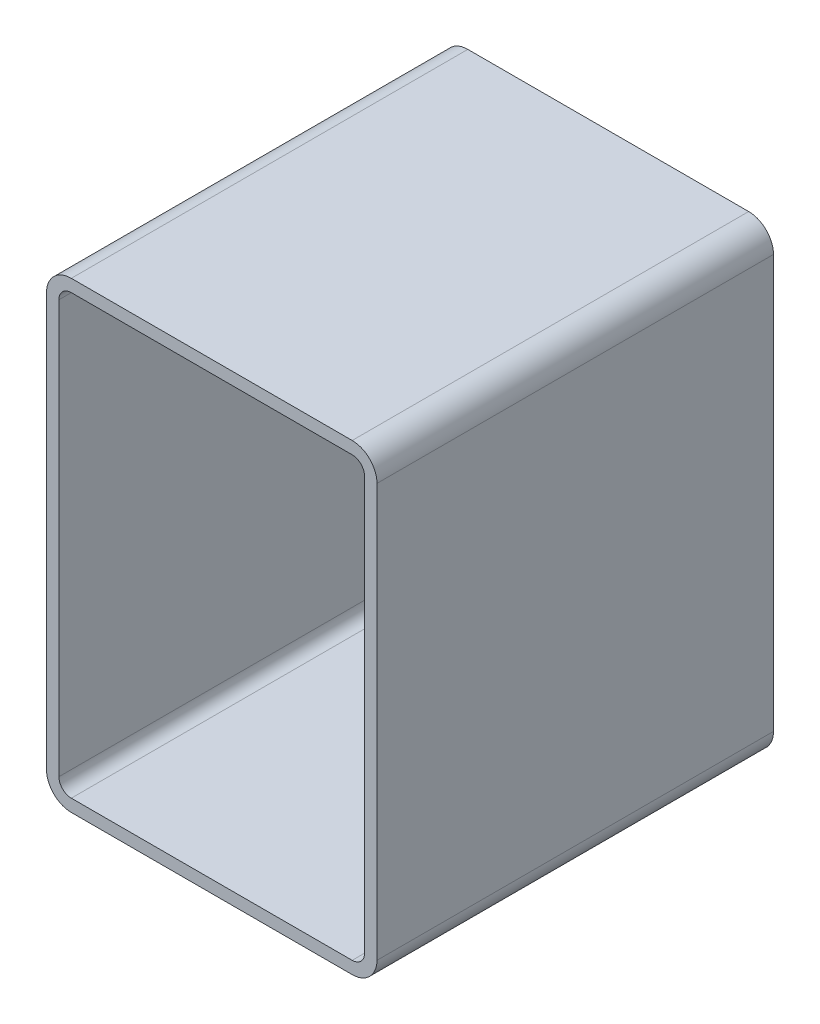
ISO-10303-21;
HEADER;
FILE_DESCRIPTION(('STEP AP214'),'2;1');
FILE_NAME('part.step','',(''),(''),'','','');
FILE_SCHEMA(('AUTOMOTIVE_DESIGN { 1 0 10303 214 1 1 1 1 }'));
ENDSEC;
DATA;
#1=APPLICATION_CONTEXT('core data for automotive mechanical design processes');
#2=APPLICATION_PROTOCOL_DEFINITION('international standard','automotive_design',2000,#1);
#3=PRODUCT_CONTEXT('',#1,'mechanical');
#4=PRODUCT('Part','Part','',(#3));
#5=PRODUCT_RELATED_PRODUCT_CATEGORY('part','',(#4));
#6=PRODUCT_DEFINITION_FORMATION('','',#4);
#7=PRODUCT_DEFINITION_CONTEXT('part definition',#1,'design');
#8=PRODUCT_DEFINITION('design','',#6,#7);
#9=PRODUCT_DEFINITION_SHAPE('','',#8);
#10=(LENGTH_UNIT() NAMED_UNIT(*) SI_UNIT(.MILLI.,.METRE.));
#11=(NAMED_UNIT(*) PLANE_ANGLE_UNIT() SI_UNIT($,.RADIAN.));
#12=(NAMED_UNIT(*) SI_UNIT($,.STERADIAN.) SOLID_ANGLE_UNIT());
#13=UNCERTAINTY_MEASURE_WITH_UNIT(LENGTH_MEASURE(1.E-05),#10,'distance_accuracy_value','');
#14=(GEOMETRIC_REPRESENTATION_CONTEXT(3) GLOBAL_UNCERTAINTY_ASSIGNED_CONTEXT((#13)) GLOBAL_UNIT_ASSIGNED_CONTEXT((#10,
#11,#12)) REPRESENTATION_CONTEXT('',''));
#15=CARTESIAN_POINT('',(0.,0.,0.));
#16=DIRECTION('',(0.,0.,1.));
#17=DIRECTION('',(1.,0.,0.));
#18=AXIS2_PLACEMENT_3D('',#15,#16,#17);
#19=CARTESIAN_POINT('',(21.7845794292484,338.378679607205,304.8));
#20=DIRECTION('',(0.,0.,1.));
#21=DIRECTION('',(1.,0.,0.));
#22=AXIS2_PLACEMENT_3D('',#19,#20,#21);
#23=PLANE('',#22);
#24=CARTESIAN_POINT('',(21.7845794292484,338.378679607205,304.8));
#25=DIRECTION('',(0.,0.,1.));
#26=DIRECTION('',(1.,0.,0.));
#27=AXIS2_PLACEMENT_3D('',#24,#25,#26);
#28=CIRCLE('',#27,19.05);
#29=CARTESIAN_POINT('',(21.7845794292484,357.428679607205,304.8));
#30=VERTEX_POINT('',#29);
#31=CARTESIAN_POINT('',(2.73457942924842,338.378679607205,304.8));
#32=VERTEX_POINT('',#31);
#33=EDGE_CURVE('E211',#30,#32,#28,.T.);
#34=ORIENTED_EDGE('',*,*,#33,.T.);
#35=DIRECTION('',(0.,-1.,0.));
#36=VECTOR('',#35,1.);
#37=CARTESIAN_POINT('',(2.73457942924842,20.8786796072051,304.8));
#38=LINE('',#37,#36);
#39=CARTESIAN_POINT('',(2.73457942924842,20.8786796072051,304.8));
#40=VERTEX_POINT('',#39);
#41=EDGE_CURVE('E214',#32,#40,#38,.T.);
#42=ORIENTED_EDGE('',*,*,#41,.T.);
#43=CARTESIAN_POINT('',(21.7845794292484,20.8786796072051,304.8));
#44=DIRECTION('',(0.,0.,1.));
#45=DIRECTION('',(1.,0.,0.));
#46=AXIS2_PLACEMENT_3D('',#43,#44,#45);
#47=CIRCLE('',#46,19.05);
#48=CARTESIAN_POINT('',(21.7845794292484,1.82867960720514,304.8));
#49=VERTEX_POINT('',#48);
#50=EDGE_CURVE('E217',#40,#49,#47,.T.);
#51=ORIENTED_EDGE('',*,*,#50,.T.);
#52=DIRECTION('',(1.,0.,0.));
#53=VECTOR('',#52,1.);
#54=CARTESIAN_POINT('',(237.684579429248,1.82867960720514,304.8));
#55=LINE('',#54,#53);
#56=CARTESIAN_POINT('',(237.684579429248,1.82867960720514,304.8));
#57=VERTEX_POINT('',#56);
#58=EDGE_CURVE('E219',#49,#57,#55,.T.);
#59=ORIENTED_EDGE('',*,*,#58,.T.);
#60=CARTESIAN_POINT('',(237.684579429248,20.8786796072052,304.8));
#61=DIRECTION('',(0.,0.,1.));
#62=DIRECTION('',(1.,0.,0.));
#63=AXIS2_PLACEMENT_3D('',#60,#61,#62);
#64=CIRCLE('',#63,19.05);
#65=CARTESIAN_POINT('',(256.734579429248,20.8786796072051,304.8));
#66=VERTEX_POINT('',#65);
#67=EDGE_CURVE('E221',#57,#66,#64,.T.);
#68=ORIENTED_EDGE('',*,*,#67,.T.);
#69=DIRECTION('',(0.,1.,0.));
#70=VECTOR('',#69,1.);
#71=CARTESIAN_POINT('',(256.734579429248,338.378679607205,304.8));
#72=LINE('',#71,#70);
#73=CARTESIAN_POINT('',(256.734579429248,338.378679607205,304.8));
#74=VERTEX_POINT('',#73);
#75=EDGE_CURVE('E223',#66,#74,#72,.T.);
#76=ORIENTED_EDGE('',*,*,#75,.T.);
#77=CARTESIAN_POINT('',(237.684579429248,338.378679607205,304.8));
#78=DIRECTION('',(0.,0.,1.));
#79=DIRECTION('',(1.,0.,0.));
#80=AXIS2_PLACEMENT_3D('',#77,#78,#79);
#81=CIRCLE('',#80,19.05);
#82=CARTESIAN_POINT('',(237.684579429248,357.428679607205,304.8));
#83=VERTEX_POINT('',#82);
#84=EDGE_CURVE('E225',#74,#83,#81,.T.);
#85=ORIENTED_EDGE('',*,*,#84,.T.);
#86=DIRECTION('',(-1.,0.,0.));
#87=VECTOR('',#86,1.);
#88=CARTESIAN_POINT('',(21.7845794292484,357.428679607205,304.8));
#89=LINE('',#88,#87);
#90=EDGE_CURVE('E227',#83,#30,#89,.T.);
#91=ORIENTED_EDGE('',*,*,#90,.T.);
#92=EDGE_LOOP('',(#34,#42,#51,#59,#68,#76,#85,#91));
#93=FACE_BOUND('',#92,.T.);
#94=DIRECTION('',(0.,-1.,0.));
#95=VECTOR('',#94,1.);
#96=CARTESIAN_POINT('',(12.2595794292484,20.8786796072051,304.8));
#97=LINE('',#96,#95);
#98=CARTESIAN_POINT('',(12.2595794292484,338.378679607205,304.8));
#99=VERTEX_POINT('',#98);
#100=CARTESIAN_POINT('',(12.2595794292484,20.8786796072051,304.8));
#101=VERTEX_POINT('',#100);
#102=EDGE_CURVE('E154',#99,#101,#97,.T.);
#103=ORIENTED_EDGE('',*,*,#102,.F.);
#104=CARTESIAN_POINT('',(21.7845794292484,338.378679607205,304.8));
#105=DIRECTION('',(0.,0.,1.));
#106=DIRECTION('',(1.,0.,0.));
#107=AXIS2_PLACEMENT_3D('',#104,#105,#106);
#108=CIRCLE('',#107,9.52499999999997);
#109=CARTESIAN_POINT('',(21.7845794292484,347.903679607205,304.8));
#110=VERTEX_POINT('',#109);
#111=EDGE_CURVE('E146',#110,#99,#108,.T.);
#112=ORIENTED_EDGE('',*,*,#111,.F.);
#113=DIRECTION('',(-1.,0.,0.));
#114=VECTOR('',#113,1.);
#115=CARTESIAN_POINT('',(21.7845794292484,347.903679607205,304.8));
#116=LINE('',#115,#114);
#117=CARTESIAN_POINT('',(237.684579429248,347.903679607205,304.8));
#118=VERTEX_POINT('',#117);
#119=EDGE_CURVE('E179',#118,#110,#116,.T.);
#120=ORIENTED_EDGE('',*,*,#119,.F.);
#121=CARTESIAN_POINT('',(237.684579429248,338.378679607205,304.8));
#122=DIRECTION('',(0.,0.,1.));
#123=DIRECTION('',(1.,0.,0.));
#124=AXIS2_PLACEMENT_3D('',#121,#122,#123);
#125=CIRCLE('',#124,9.52499999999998);
#126=CARTESIAN_POINT('',(247.209579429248,338.378679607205,304.8));
#127=VERTEX_POINT('',#126);
#128=EDGE_CURVE('E177',#127,#118,#125,.T.);
#129=ORIENTED_EDGE('',*,*,#128,.F.);
#130=DIRECTION('',(0.,1.,0.));
#131=VECTOR('',#130,1.);
#132=CARTESIAN_POINT('',(247.209579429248,338.378679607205,304.8));
#133=LINE('',#132,#131);
#134=CARTESIAN_POINT('',(247.209579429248,20.8786796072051,304.8));
#135=VERTEX_POINT('',#134);
#136=EDGE_CURVE('E175',#135,#127,#133,.T.);
#137=ORIENTED_EDGE('',*,*,#136,.F.);
#138=CARTESIAN_POINT('',(237.684579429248,20.8786796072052,304.8));
#139=DIRECTION('',(0.,0.,1.));
#140=DIRECTION('',(1.,0.,0.));
#141=AXIS2_PLACEMENT_3D('',#138,#139,#140);
#142=CIRCLE('',#141,9.52500000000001);
#143=CARTESIAN_POINT('',(237.684579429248,11.3536796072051,304.8));
#144=VERTEX_POINT('',#143);
#145=EDGE_CURVE('E173',#144,#135,#142,.T.);
#146=ORIENTED_EDGE('',*,*,#145,.F.);
#147=DIRECTION('',(1.,0.,0.));
#148=VECTOR('',#147,1.);
#149=CARTESIAN_POINT('',(237.684579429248,11.3536796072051,304.8));
#150=LINE('',#149,#148);
#151=CARTESIAN_POINT('',(21.7845794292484,11.3536796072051,304.8));
#152=VERTEX_POINT('',#151);
#153=EDGE_CURVE('E169',#152,#144,#150,.T.);
#154=ORIENTED_EDGE('',*,*,#153,.F.);
#155=CARTESIAN_POINT('',(21.7845794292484,20.8786796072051,304.8));
#156=DIRECTION('',(0.,0.,1.));
#157=DIRECTION('',(1.,0.,0.));
#158=AXIS2_PLACEMENT_3D('',#155,#156,#157);
#159=CIRCLE('',#158,9.525);
#160=EDGE_CURVE('E167',#101,#152,#159,.T.);
#161=ORIENTED_EDGE('',*,*,#160,.F.);
#162=EDGE_LOOP('',(#103,#112,#120,#129,#137,#146,#154,#161));
#163=FACE_BOUND('',#162,.T.);
#164=ADVANCED_FACE('F33',(#93,#163),#23,.T.);
#165=CARTESIAN_POINT('',(21.7845794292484,338.378679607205,0.));
#166=DIRECTION('',(0.,0.,1.));
#167=DIRECTION('',(1.,0.,0.));
#168=AXIS2_PLACEMENT_3D('',#165,#166,#167);
#169=PLANE('',#168);
#170=CARTESIAN_POINT('',(21.7845794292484,338.378679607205,0.));
#171=DIRECTION('',(0.,0.,1.));
#172=DIRECTION('',(1.,0.,0.));
#173=AXIS2_PLACEMENT_3D('',#170,#171,#172);
#174=CIRCLE('',#173,19.05);
#175=CARTESIAN_POINT('',(21.7845794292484,357.428679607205,0.));
#176=VERTEX_POINT('',#175);
#177=CARTESIAN_POINT('',(2.73457942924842,338.378679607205,0.));
#178=VERTEX_POINT('',#177);
#179=EDGE_CURVE('E162',#176,#178,#174,.T.);
#180=ORIENTED_EDGE('',*,*,#179,.F.);
#181=DIRECTION('',(-1.,0.,0.));
#182=VECTOR('',#181,1.);
#183=CARTESIAN_POINT('',(21.7845794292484,357.428679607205,0.));
#184=LINE('',#183,#182);
#185=CARTESIAN_POINT('',(237.684579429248,357.428679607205,0.));
#186=VERTEX_POINT('',#185);
#187=EDGE_CURVE('E215',#186,#176,#184,.T.);
#188=ORIENTED_EDGE('',*,*,#187,.F.);
#189=CARTESIAN_POINT('',(237.684579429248,338.378679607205,0.));
#190=DIRECTION('',(0.,0.,1.));
#191=DIRECTION('',(1.,0.,0.));
#192=AXIS2_PLACEMENT_3D('',#189,#190,#191);
#193=CIRCLE('',#192,19.05);
#194=CARTESIAN_POINT('',(256.734579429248,338.378679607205,0.));
#195=VERTEX_POINT('',#194);
#196=EDGE_CURVE('E242',#195,#186,#193,.T.);
#197=ORIENTED_EDGE('',*,*,#196,.F.);
#198=DIRECTION('',(0.,1.,0.));
#199=VECTOR('',#198,1.);
#200=CARTESIAN_POINT('',(256.734579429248,338.378679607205,0.));
#201=LINE('',#200,#199);
#202=CARTESIAN_POINT('',(256.734579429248,20.8786796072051,0.));
#203=VERTEX_POINT('',#202);
#204=EDGE_CURVE('E240',#203,#195,#201,.T.);
#205=ORIENTED_EDGE('',*,*,#204,.F.);
#206=CARTESIAN_POINT('',(237.684579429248,20.8786796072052,0.));
#207=DIRECTION('',(0.,0.,1.));
#208=DIRECTION('',(1.,0.,0.));
#209=AXIS2_PLACEMENT_3D('',#206,#207,#208);
#210=CIRCLE('',#209,19.05);
#211=CARTESIAN_POINT('',(237.684579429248,1.82867960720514,0.));
#212=VERTEX_POINT('',#211);
#213=EDGE_CURVE('E238',#212,#203,#210,.T.);
#214=ORIENTED_EDGE('',*,*,#213,.F.);
#215=DIRECTION('',(1.,0.,0.));
#216=VECTOR('',#215,1.);
#217=CARTESIAN_POINT('',(237.684579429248,1.82867960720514,0.));
#218=LINE('',#217,#216);
#219=CARTESIAN_POINT('',(21.7845794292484,1.82867960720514,0.));
#220=VERTEX_POINT('',#219);
#221=EDGE_CURVE('E236',#220,#212,#218,.T.);
#222=ORIENTED_EDGE('',*,*,#221,.F.);
#223=CARTESIAN_POINT('',(21.7845794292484,20.8786796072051,0.));
#224=DIRECTION('',(0.,0.,1.));
#225=DIRECTION('',(1.,0.,0.));
#226=AXIS2_PLACEMENT_3D('',#223,#224,#225);
#227=CIRCLE('',#226,19.05);
#228=CARTESIAN_POINT('',(2.73457942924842,20.8786796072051,0.));
#229=VERTEX_POINT('',#228);
#230=EDGE_CURVE('E234',#229,#220,#227,.T.);
#231=ORIENTED_EDGE('',*,*,#230,.F.);
#232=DIRECTION('',(0.,-1.,0.));
#233=VECTOR('',#232,1.);
#234=CARTESIAN_POINT('',(2.73457942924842,20.8786796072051,0.));
#235=LINE('',#234,#233);
#236=EDGE_CURVE('E232',#178,#229,#235,.T.);
#237=ORIENTED_EDGE('',*,*,#236,.F.);
#238=EDGE_LOOP('',(#180,#188,#197,#205,#214,#222,#231,#237));
#239=FACE_BOUND('',#238,.T.);
#240=CARTESIAN_POINT('',(21.7845794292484,338.378679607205,0.));
#241=DIRECTION('',(0.,0.,1.));
#242=DIRECTION('',(1.,0.,0.));
#243=AXIS2_PLACEMENT_3D('',#240,#241,#242);
#244=CIRCLE('',#243,9.52499999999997);
#245=CARTESIAN_POINT('',(21.7845794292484,347.903679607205,0.));
#246=VERTEX_POINT('',#245);
#247=CARTESIAN_POINT('',(12.2595794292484,338.378679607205,0.));
#248=VERTEX_POINT('',#247);
#249=EDGE_CURVE('E56',#246,#248,#244,.T.);
#250=ORIENTED_EDGE('',*,*,#249,.T.);
#251=DIRECTION('',(0.,-1.,0.));
#252=VECTOR('',#251,1.);
#253=CARTESIAN_POINT('',(12.2595794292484,20.8786796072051,0.));
#254=LINE('',#253,#252);
#255=CARTESIAN_POINT('',(12.2595794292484,20.8786796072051,0.));
#256=VERTEX_POINT('',#255);
#257=EDGE_CURVE('E161',#248,#256,#254,.T.);
#258=ORIENTED_EDGE('',*,*,#257,.T.);
#259=CARTESIAN_POINT('',(21.7845794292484,20.8786796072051,0.));
#260=DIRECTION('',(0.,0.,1.));
#261=DIRECTION('',(1.,0.,0.));
#262=AXIS2_PLACEMENT_3D('',#259,#260,#261);
#263=CIRCLE('',#262,9.525);
#264=CARTESIAN_POINT('',(21.7845794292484,11.3536796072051,0.));
#265=VERTEX_POINT('',#264);
#266=EDGE_CURVE('E183',#256,#265,#263,.T.);
#267=ORIENTED_EDGE('',*,*,#266,.T.);
#268=DIRECTION('',(1.,0.,0.));
#269=VECTOR('',#268,1.);
#270=CARTESIAN_POINT('',(237.684579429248,11.3536796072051,0.));
#271=LINE('',#270,#269);
#272=CARTESIAN_POINT('',(237.684579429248,11.3536796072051,0.));
#273=VERTEX_POINT('',#272);
#274=EDGE_CURVE('E186',#265,#273,#271,.T.);
#275=ORIENTED_EDGE('',*,*,#274,.T.);
#276=CARTESIAN_POINT('',(237.684579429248,20.8786796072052,0.));
#277=DIRECTION('',(0.,0.,1.));
#278=DIRECTION('',(1.,0.,0.));
#279=AXIS2_PLACEMENT_3D('',#276,#277,#278);
#280=CIRCLE('',#279,9.52500000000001);
#281=CARTESIAN_POINT('',(247.209579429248,20.8786796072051,0.));
#282=VERTEX_POINT('',#281);
#283=EDGE_CURVE('E189',#273,#282,#280,.T.);
#284=ORIENTED_EDGE('',*,*,#283,.T.);
#285=DIRECTION('',(0.,1.,0.));
#286=VECTOR('',#285,1.);
#287=CARTESIAN_POINT('',(247.209579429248,338.378679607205,0.));
#288=LINE('',#287,#286);
#289=CARTESIAN_POINT('',(247.209579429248,338.378679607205,0.));
#290=VERTEX_POINT('',#289);
#291=EDGE_CURVE('E192',#282,#290,#288,.T.);
#292=ORIENTED_EDGE('',*,*,#291,.T.);
#293=CARTESIAN_POINT('',(237.684579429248,338.378679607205,0.));
#294=DIRECTION('',(0.,0.,1.));
#295=DIRECTION('',(1.,0.,0.));
#296=AXIS2_PLACEMENT_3D('',#293,#294,#295);
#297=CIRCLE('',#296,9.52499999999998);
#298=CARTESIAN_POINT('',(237.684579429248,347.903679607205,0.));
#299=VERTEX_POINT('',#298);
#300=EDGE_CURVE('E195',#290,#299,#297,.T.);
#301=ORIENTED_EDGE('',*,*,#300,.T.);
#302=DIRECTION('',(-1.,0.,0.));
#303=VECTOR('',#302,1.);
#304=CARTESIAN_POINT('',(21.7845794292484,347.903679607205,0.));
#305=LINE('',#304,#303);
#306=EDGE_CURVE('E155',#299,#246,#305,.T.);
#307=ORIENTED_EDGE('',*,*,#306,.T.);
#308=EDGE_LOOP('',(#250,#258,#267,#275,#284,#292,#301,#307));
#309=FACE_BOUND('',#308,.T.);
#310=ADVANCED_FACE('F272',(#239,#309),#169,.F.);
#311=CARTESIAN_POINT('',(21.7845794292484,338.378679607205,304.8));
#312=DIRECTION('',(0.,0.,-1.));
#313=DIRECTION('',(-1.,0.,0.));
#314=AXIS2_PLACEMENT_3D('',#311,#312,#313);
#315=CYLINDRICAL_SURFACE('',#314,19.05);
#316=ORIENTED_EDGE('',*,*,#179,.T.);
#317=DIRECTION('',(0.,0.,-1.));
#318=VECTOR('',#317,1.);
#319=CARTESIAN_POINT('',(2.73457942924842,338.378679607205,304.8));
#320=LINE('',#319,#318);
#321=EDGE_CURVE('E11',#32,#178,#320,.T.);
#322=ORIENTED_EDGE('',*,*,#321,.F.);
#323=ORIENTED_EDGE('',*,*,#33,.F.);
#324=DIRECTION('',(0.,0.,-1.));
#325=VECTOR('',#324,1.);
#326=CARTESIAN_POINT('',(21.7845794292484,357.428679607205,304.8));
#327=LINE('',#326,#325);
#328=EDGE_CURVE('E229',#30,#176,#327,.T.);
#329=ORIENTED_EDGE('',*,*,#328,.T.);
#330=EDGE_LOOP('',(#316,#322,#323,#329));
#331=FACE_BOUND('',#330,.T.);
#332=ADVANCED_FACE('F35',(#331),#315,.T.);
#333=CARTESIAN_POINT('',(2.73457942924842,20.8786796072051,304.8));
#334=DIRECTION('',(1.,0.,0.));
#335=DIRECTION('',(0.,0.,-1.));
#336=AXIS2_PLACEMENT_3D('',#333,#334,#335);
#337=PLANE('',#336);
#338=ORIENTED_EDGE('',*,*,#236,.T.);
#339=DIRECTION('',(0.,0.,-1.));
#340=VECTOR('',#339,1.);
#341=CARTESIAN_POINT('',(2.73457942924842,20.8786796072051,304.8));
#342=LINE('',#341,#340);
#343=EDGE_CURVE('E41',#40,#229,#342,.T.);
#344=ORIENTED_EDGE('',*,*,#343,.F.);
#345=ORIENTED_EDGE('',*,*,#41,.F.);
#346=ORIENTED_EDGE('',*,*,#321,.T.);
#347=EDGE_LOOP('',(#338,#344,#345,#346));
#348=FACE_BOUND('',#347,.T.);
#349=ADVANCED_FACE('F289',(#348),#337,.F.);
#350=CARTESIAN_POINT('',(21.7845794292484,20.8786796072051,304.8));
#351=DIRECTION('',(0.,0.,-1.));
#352=DIRECTION('',(-1.,0.,0.));
#353=AXIS2_PLACEMENT_3D('',#350,#351,#352);
#354=CYLINDRICAL_SURFACE('',#353,19.05);
#355=ORIENTED_EDGE('',*,*,#230,.T.);
#356=DIRECTION('',(0.,0.,-1.));
#357=VECTOR('',#356,1.);
#358=CARTESIAN_POINT('',(21.7845794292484,1.82867960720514,304.8));
#359=LINE('',#358,#357);
#360=EDGE_CURVE('E259',#49,#220,#359,.T.);
#361=ORIENTED_EDGE('',*,*,#360,.F.);
#362=ORIENTED_EDGE('',*,*,#50,.F.);
#363=ORIENTED_EDGE('',*,*,#343,.T.);
#364=EDGE_LOOP('',(#355,#361,#362,#363));
#365=FACE_BOUND('',#364,.T.);
#366=ADVANCED_FACE('F266',(#365),#354,.T.);
#367=CARTESIAN_POINT('',(237.684579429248,1.82867960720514,304.8));
#368=DIRECTION('',(0.,1.,0.));
#369=DIRECTION('',(0.,0.,1.));
#370=AXIS2_PLACEMENT_3D('',#367,#368,#369);
#371=PLANE('',#370);
#372=ORIENTED_EDGE('',*,*,#221,.T.);
#373=DIRECTION('',(0.,0.,-1.));
#374=VECTOR('',#373,1.);
#375=CARTESIAN_POINT('',(237.684579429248,1.82867960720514,304.8));
#376=LINE('',#375,#374);
#377=EDGE_CURVE('E256',#57,#212,#376,.T.);
#378=ORIENTED_EDGE('',*,*,#377,.F.);
#379=ORIENTED_EDGE('',*,*,#58,.F.);
#380=ORIENTED_EDGE('',*,*,#360,.T.);
#381=EDGE_LOOP('',(#372,#378,#379,#380));
#382=FACE_BOUND('',#381,.T.);
#383=ADVANCED_FACE('F278',(#382),#371,.F.);
#384=CARTESIAN_POINT('',(237.684579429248,20.8786796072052,304.8));
#385=DIRECTION('',(0.,0.,-1.));
#386=DIRECTION('',(-1.,0.,0.));
#387=AXIS2_PLACEMENT_3D('',#384,#385,#386);
#388=CYLINDRICAL_SURFACE('',#387,19.05);
#389=ORIENTED_EDGE('',*,*,#213,.T.);
#390=DIRECTION('',(0.,0.,-1.));
#391=VECTOR('',#390,1.);
#392=CARTESIAN_POINT('',(256.734579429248,20.8786796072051,304.8));
#393=LINE('',#392,#391);
#394=EDGE_CURVE('E253',#66,#203,#393,.T.);
#395=ORIENTED_EDGE('',*,*,#394,.F.);
#396=ORIENTED_EDGE('',*,*,#67,.F.);
#397=ORIENTED_EDGE('',*,*,#377,.T.);
#398=EDGE_LOOP('',(#389,#395,#396,#397));
#399=FACE_BOUND('',#398,.T.);
#400=ADVANCED_FACE('F282',(#399),#388,.T.);
#401=CARTESIAN_POINT('',(256.734579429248,338.378679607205,304.8));
#402=DIRECTION('',(-1.,0.,0.));
#403=DIRECTION('',(0.,0.,1.));
#404=AXIS2_PLACEMENT_3D('',#401,#402,#403);
#405=PLANE('',#404);
#406=ORIENTED_EDGE('',*,*,#204,.T.);
#407=DIRECTION('',(0.,0.,-1.));
#408=VECTOR('',#407,1.);
#409=CARTESIAN_POINT('',(256.734579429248,338.378679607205,304.8));
#410=LINE('',#409,#408);
#411=EDGE_CURVE('E250',#74,#195,#410,.T.);
#412=ORIENTED_EDGE('',*,*,#411,.F.);
#413=ORIENTED_EDGE('',*,*,#75,.F.);
#414=ORIENTED_EDGE('',*,*,#394,.T.);
#415=EDGE_LOOP('',(#406,#412,#413,#414));
#416=FACE_BOUND('',#415,.T.);
#417=ADVANCED_FACE('F302',(#416),#405,.F.);
#418=CARTESIAN_POINT('',(237.684579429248,338.378679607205,304.8));
#419=DIRECTION('',(0.,0.,-1.));
#420=DIRECTION('',(-1.,0.,0.));
#421=AXIS2_PLACEMENT_3D('',#418,#419,#420);
#422=CYLINDRICAL_SURFACE('',#421,19.05);
#423=ORIENTED_EDGE('',*,*,#196,.T.);
#424=DIRECTION('',(0.,0.,-1.));
#425=VECTOR('',#424,1.);
#426=CARTESIAN_POINT('',(237.684579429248,357.428679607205,304.8));
#427=LINE('',#426,#425);
#428=EDGE_CURVE('E247',#83,#186,#427,.T.);
#429=ORIENTED_EDGE('',*,*,#428,.F.);
#430=ORIENTED_EDGE('',*,*,#84,.F.);
#431=ORIENTED_EDGE('',*,*,#411,.T.);
#432=EDGE_LOOP('',(#423,#429,#430,#431));
#433=FACE_BOUND('',#432,.T.);
#434=ADVANCED_FACE('F300',(#433),#422,.T.);
#435=CARTESIAN_POINT('',(21.7845794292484,357.428679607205,304.8));
#436=DIRECTION('',(0.,-1.,0.));
#437=DIRECTION('',(0.,0.,-1.));
#438=AXIS2_PLACEMENT_3D('',#435,#436,#437);
#439=PLANE('',#438);
#440=ORIENTED_EDGE('',*,*,#187,.T.);
#441=ORIENTED_EDGE('',*,*,#328,.F.);
#442=ORIENTED_EDGE('',*,*,#90,.F.);
#443=ORIENTED_EDGE('',*,*,#428,.T.);
#444=EDGE_LOOP('',(#440,#441,#442,#443));
#445=FACE_BOUND('',#444,.T.);
#446=ADVANCED_FACE('F295',(#445),#439,.F.);
#447=CARTESIAN_POINT('',(21.7845794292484,338.378679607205,304.8));
#448=DIRECTION('',(0.,0.,-1.));
#449=DIRECTION('',(-1.,0.,0.));
#450=AXIS2_PLACEMENT_3D('',#447,#448,#449);
#451=CYLINDRICAL_SURFACE('',#450,9.52499999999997);
#452=ORIENTED_EDGE('',*,*,#249,.F.);
#453=DIRECTION('',(0.,0.,-1.));
#454=VECTOR('',#453,1.);
#455=CARTESIAN_POINT('',(21.7845794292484,347.903679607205,304.8));
#456=LINE('',#455,#454);
#457=EDGE_CURVE('E150',#110,#246,#456,.T.);
#458=ORIENTED_EDGE('',*,*,#457,.F.);
#459=ORIENTED_EDGE('',*,*,#111,.T.);
#460=DIRECTION('',(0.,0.,-1.));
#461=VECTOR('',#460,1.);
#462=CARTESIAN_POINT('',(12.2595794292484,338.378679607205,304.8));
#463=LINE('',#462,#461);
#464=EDGE_CURVE('E149',#99,#248,#463,.T.);
#465=ORIENTED_EDGE('',*,*,#464,.T.);
#466=EDGE_LOOP('',(#452,#458,#459,#465));
#467=FACE_BOUND('',#466,.T.);
#468=ADVANCED_FACE('F148',(#467),#451,.F.);
#469=CARTESIAN_POINT('',(12.2595794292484,20.8786796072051,304.8));
#470=DIRECTION('',(1.,0.,0.));
#471=DIRECTION('',(0.,0.,-1.));
#472=AXIS2_PLACEMENT_3D('',#469,#470,#471);
#473=PLANE('',#472);
#474=ORIENTED_EDGE('',*,*,#257,.F.);
#475=ORIENTED_EDGE('',*,*,#464,.F.);
#476=ORIENTED_EDGE('',*,*,#102,.T.);
#477=DIRECTION('',(0.,0.,-1.));
#478=VECTOR('',#477,1.);
#479=CARTESIAN_POINT('',(12.2595794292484,20.8786796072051,304.8));
#480=LINE('',#479,#478);
#481=EDGE_CURVE('E163',#101,#256,#480,.T.);
#482=ORIENTED_EDGE('',*,*,#481,.T.);
#483=EDGE_LOOP('',(#474,#475,#476,#482));
#484=FACE_BOUND('',#483,.T.);
#485=ADVANCED_FACE('F158',(#484),#473,.T.);
#486=CARTESIAN_POINT('',(21.7845794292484,20.8786796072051,304.8));
#487=DIRECTION('',(0.,0.,-1.));
#488=DIRECTION('',(-1.,0.,0.));
#489=AXIS2_PLACEMENT_3D('',#486,#487,#488);
#490=CYLINDRICAL_SURFACE('',#489,9.525);
#491=ORIENTED_EDGE('',*,*,#266,.F.);
#492=ORIENTED_EDGE('',*,*,#481,.F.);
#493=ORIENTED_EDGE('',*,*,#160,.T.);
#494=DIRECTION('',(0.,0.,-1.));
#495=VECTOR('',#494,1.);
#496=CARTESIAN_POINT('',(21.7845794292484,11.3536796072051,304.8));
#497=LINE('',#496,#495);
#498=EDGE_CURVE('E208',#152,#265,#497,.T.);
#499=ORIENTED_EDGE('',*,*,#498,.T.);
#500=EDGE_LOOP('',(#491,#492,#493,#499));
#501=FACE_BOUND('',#500,.T.);
#502=ADVANCED_FACE('F327',(#501),#490,.F.);
#503=CARTESIAN_POINT('',(237.684579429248,11.3536796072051,304.8));
#504=DIRECTION('',(0.,1.,0.));
#505=DIRECTION('',(0.,0.,1.));
#506=AXIS2_PLACEMENT_3D('',#503,#504,#505);
#507=PLANE('',#506);
#508=ORIENTED_EDGE('',*,*,#274,.F.);
#509=ORIENTED_EDGE('',*,*,#498,.F.);
#510=ORIENTED_EDGE('',*,*,#153,.T.);
#511=DIRECTION('',(0.,0.,-1.));
#512=VECTOR('',#511,1.);
#513=CARTESIAN_POINT('',(237.684579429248,11.3536796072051,304.8));
#514=LINE('',#513,#512);
#515=EDGE_CURVE('E206',#144,#273,#514,.T.);
#516=ORIENTED_EDGE('',*,*,#515,.T.);
#517=EDGE_LOOP('',(#508,#509,#510,#516));
#518=FACE_BOUND('',#517,.T.);
#519=ADVANCED_FACE('F331',(#518),#507,.T.);
#520=CARTESIAN_POINT('',(237.684579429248,20.8786796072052,304.8));
#521=DIRECTION('',(0.,0.,-1.));
#522=DIRECTION('',(-1.,0.,0.));
#523=AXIS2_PLACEMENT_3D('',#520,#521,#522);
#524=CYLINDRICAL_SURFACE('',#523,9.52500000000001);
#525=ORIENTED_EDGE('',*,*,#283,.F.);
#526=ORIENTED_EDGE('',*,*,#515,.F.);
#527=ORIENTED_EDGE('',*,*,#145,.T.);
#528=DIRECTION('',(0.,0.,-1.));
#529=VECTOR('',#528,1.);
#530=CARTESIAN_POINT('',(247.209579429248,20.8786796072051,304.8));
#531=LINE('',#530,#529);
#532=EDGE_CURVE('E204',#135,#282,#531,.T.);
#533=ORIENTED_EDGE('',*,*,#532,.T.);
#534=EDGE_LOOP('',(#525,#526,#527,#533));
#535=FACE_BOUND('',#534,.T.);
#536=ADVANCED_FACE('F337',(#535),#524,.F.);
#537=CARTESIAN_POINT('',(247.209579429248,338.378679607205,304.8));
#538=DIRECTION('',(-1.,0.,0.));
#539=DIRECTION('',(0.,0.,1.));
#540=AXIS2_PLACEMENT_3D('',#537,#538,#539);
#541=PLANE('',#540);
#542=ORIENTED_EDGE('',*,*,#291,.F.);
#543=ORIENTED_EDGE('',*,*,#532,.F.);
#544=ORIENTED_EDGE('',*,*,#136,.T.);
#545=DIRECTION('',(0.,0.,-1.));
#546=VECTOR('',#545,1.);
#547=CARTESIAN_POINT('',(247.209579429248,338.378679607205,304.8));
#548=LINE('',#547,#546);
#549=EDGE_CURVE('E202',#127,#290,#548,.T.);
#550=ORIENTED_EDGE('',*,*,#549,.T.);
#551=EDGE_LOOP('',(#542,#543,#544,#550));
#552=FACE_BOUND('',#551,.T.);
#553=ADVANCED_FACE('F341',(#552),#541,.T.);
#554=CARTESIAN_POINT('',(237.684579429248,338.378679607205,304.8));
#555=DIRECTION('',(0.,0.,-1.));
#556=DIRECTION('',(-1.,0.,0.));
#557=AXIS2_PLACEMENT_3D('',#554,#555,#556);
#558=CYLINDRICAL_SURFACE('',#557,9.52499999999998);
#559=ORIENTED_EDGE('',*,*,#300,.F.);
#560=ORIENTED_EDGE('',*,*,#549,.F.);
#561=ORIENTED_EDGE('',*,*,#128,.T.);
#562=DIRECTION('',(0.,0.,-1.));
#563=VECTOR('',#562,1.);
#564=CARTESIAN_POINT('',(237.684579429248,347.903679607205,304.8));
#565=LINE('',#564,#563);
#566=EDGE_CURVE('E48',#118,#299,#565,.T.);
#567=ORIENTED_EDGE('',*,*,#566,.T.);
#568=EDGE_LOOP('',(#559,#560,#561,#567));
#569=FACE_BOUND('',#568,.T.);
#570=ADVANCED_FACE('F345',(#569),#558,.F.);
#571=CARTESIAN_POINT('',(21.7845794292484,347.903679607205,304.8));
#572=DIRECTION('',(0.,-1.,0.));
#573=DIRECTION('',(0.,0.,-1.));
#574=AXIS2_PLACEMENT_3D('',#571,#572,#573);
#575=PLANE('',#574);
#576=ORIENTED_EDGE('',*,*,#306,.F.);
#577=ORIENTED_EDGE('',*,*,#566,.F.);
#578=ORIENTED_EDGE('',*,*,#119,.T.);
#579=ORIENTED_EDGE('',*,*,#457,.T.);
#580=EDGE_LOOP('',(#576,#577,#578,#579));
#581=FACE_BOUND('',#580,.T.);
#582=ADVANCED_FACE('F349',(#581),#575,.T.);
#583=CLOSED_SHELL('',(#164,#310,#332,#349,#366,#383,#400,#417,#434,#446,#468,#485,#502,#519,
#536,#553,#570,#582));
#584=MANIFOLD_SOLID_BREP('B2',#583);
#585=ADVANCED_BREP_SHAPE_REPRESENTATION('',(#18,#584),#14);
#586=SHAPE_DEFINITION_REPRESENTATION(#9,#585);
ENDSEC;
END-ISO-10303-21;
